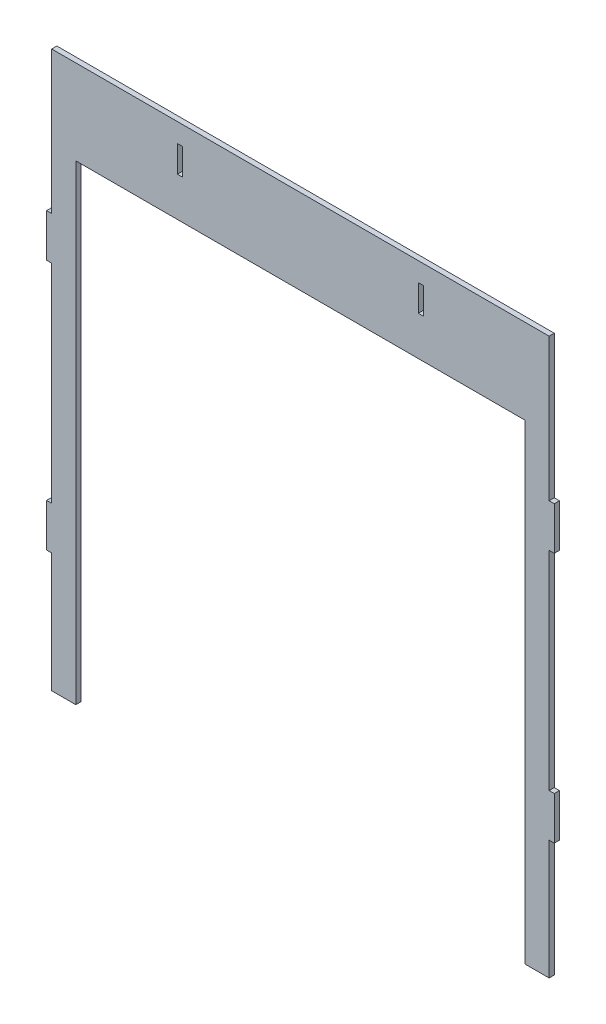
ISO-10303-21;
HEADER;
FILE_DESCRIPTION(('STEP AP214'),'2;1');
FILE_NAME('part.step','',(''),(''),'','','');
FILE_SCHEMA(('AUTOMOTIVE_DESIGN { 1 0 10303 214 1 1 1 1 }'));
ENDSEC;
DATA;
#1=APPLICATION_CONTEXT('core data for automotive mechanical design processes');
#2=APPLICATION_PROTOCOL_DEFINITION('international standard','automotive_design',2000,#1);
#3=PRODUCT_CONTEXT('',#1,'mechanical');
#4=PRODUCT('Part','Part','',(#3));
#5=PRODUCT_RELATED_PRODUCT_CATEGORY('part','',(#4));
#6=PRODUCT_DEFINITION_FORMATION('','',#4);
#7=PRODUCT_DEFINITION_CONTEXT('part definition',#1,'design');
#8=PRODUCT_DEFINITION('design','',#6,#7);
#9=PRODUCT_DEFINITION_SHAPE('','',#8);
#10=(LENGTH_UNIT() NAMED_UNIT(*) SI_UNIT(.MILLI.,.METRE.));
#11=(NAMED_UNIT(*) PLANE_ANGLE_UNIT() SI_UNIT($,.RADIAN.));
#12=(NAMED_UNIT(*) SI_UNIT($,.STERADIAN.) SOLID_ANGLE_UNIT());
#13=UNCERTAINTY_MEASURE_WITH_UNIT(LENGTH_MEASURE(1.E-05),#10,'distance_accuracy_value','');
#14=(GEOMETRIC_REPRESENTATION_CONTEXT(3) GLOBAL_UNCERTAINTY_ASSIGNED_CONTEXT((#13)) GLOBAL_UNIT_ASSIGNED_CONTEXT((#10,
#11,#12)) REPRESENTATION_CONTEXT('',''));
#15=CARTESIAN_POINT('',(0.,0.,0.));
#16=DIRECTION('',(0.,0.,1.));
#17=DIRECTION('',(1.,0.,0.));
#18=AXIS2_PLACEMENT_3D('',#15,#16,#17);
#19=CARTESIAN_POINT('',(0.,61.1688364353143,1.524));
#20=DIRECTION('',(-1.,0.,0.));
#21=DIRECTION('',(0.,0.,1.));
#22=AXIS2_PLACEMENT_3D('',#19,#20,#21);
#23=PLANE('',#22);
#24=DIRECTION('',(0.,1.,0.));
#25=VECTOR('',#24,1.);
#26=CARTESIAN_POINT('',(0.,61.1688364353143,0.));
#27=LINE('',#26,#25);
#28=CARTESIAN_POINT('',(0.,61.1688364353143,0.));
#29=VERTEX_POINT('',#28);
#30=CARTESIAN_POINT('',(0.,122.630588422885,0.));
#31=VERTEX_POINT('',#30);
#32=EDGE_CURVE('E306',#29,#31,#27,.T.);
#33=ORIENTED_EDGE('',*,*,#32,.T.);
#34=DIRECTION('',(0.,0.,-1.));
#35=VECTOR('',#34,1.);
#36=CARTESIAN_POINT('',(0.,122.630588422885,1.524));
#37=LINE('',#36,#35);
#38=CARTESIAN_POINT('',(0.,122.630588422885,1.524));
#39=VERTEX_POINT('',#38);
#40=EDGE_CURVE('E11',#39,#31,#37,.T.);
#41=ORIENTED_EDGE('',*,*,#40,.F.);
#42=DIRECTION('',(0.,1.,0.));
#43=VECTOR('',#42,1.);
#44=CARTESIAN_POINT('',(0.,61.1688364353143,1.524));
#45=LINE('',#44,#43);
#46=CARTESIAN_POINT('',(0.,61.1688364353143,1.524));
#47=VERTEX_POINT('',#46);
#48=EDGE_CURVE('E313',#47,#39,#45,.T.);
#49=ORIENTED_EDGE('',*,*,#48,.F.);
#50=DIRECTION('',(0.,0.,-1.));
#51=VECTOR('',#50,1.);
#52=CARTESIAN_POINT('',(0.,61.1688364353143,1.524));
#53=LINE('',#52,#51);
#54=EDGE_CURVE('E363',#47,#29,#53,.T.);
#55=ORIENTED_EDGE('',*,*,#54,.T.);
#56=EDGE_LOOP('',(#33,#41,#49,#55));
#57=FACE_BOUND('',#56,.T.);
#58=ADVANCED_FACE('F36',(#57),#23,.F.);
#59=CARTESIAN_POINT('',(0.,122.630588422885,1.524));
#60=DIRECTION('',(0.,1.,0.));
#61=DIRECTION('',(0.,0.,1.));
#62=AXIS2_PLACEMENT_3D('',#59,#60,#61);
#63=PLANE('',#62);
#64=DIRECTION('',(1.,0.,0.));
#65=VECTOR('',#64,1.);
#66=CARTESIAN_POINT('',(0.,122.630588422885,0.));
#67=LINE('',#66,#65);
#68=CARTESIAN_POINT('',(1.524,122.630588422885,0.));
#69=VERTEX_POINT('',#68);
#70=EDGE_CURVE('E366',#31,#69,#67,.T.);
#71=ORIENTED_EDGE('',*,*,#70,.T.);
#72=DIRECTION('',(0.,0.,-1.));
#73=VECTOR('',#72,1.);
#74=CARTESIAN_POINT('',(1.524,122.630588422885,1.524));
#75=LINE('',#74,#73);
#76=CARTESIAN_POINT('',(1.524,122.630588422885,1.524));
#77=VERTEX_POINT('',#76);
#78=EDGE_CURVE('E43',#77,#69,#75,.T.);
#79=ORIENTED_EDGE('',*,*,#78,.F.);
#80=DIRECTION('',(1.,0.,0.));
#81=VECTOR('',#80,1.);
#82=CARTESIAN_POINT('',(0.,122.630588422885,1.524));
#83=LINE('',#82,#81);
#84=EDGE_CURVE('E316',#39,#77,#83,.T.);
#85=ORIENTED_EDGE('',*,*,#84,.F.);
#86=ORIENTED_EDGE('',*,*,#40,.T.);
#87=EDGE_LOOP('',(#71,#79,#85,#86));
#88=FACE_BOUND('',#87,.T.);
#89=ADVANCED_FACE('F502',(#88),#63,.F.);
#90=CARTESIAN_POINT('',(1.524,122.630588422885,1.524));
#91=DIRECTION('',(-1.,0.,0.));
#92=DIRECTION('',(0.,0.,1.));
#93=AXIS2_PLACEMENT_3D('',#90,#91,#92);
#94=PLANE('',#93);
#95=DIRECTION('',(0.,1.,0.));
#96=VECTOR('',#95,1.);
#97=CARTESIAN_POINT('',(1.524,122.630588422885,0.));
#98=LINE('',#97,#96);
#99=CARTESIAN_POINT('',(1.524,135.330588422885,0.));
#100=VERTEX_POINT('',#99);
#101=EDGE_CURVE('E368',#69,#100,#98,.T.);
#102=ORIENTED_EDGE('',*,*,#101,.T.);
#103=DIRECTION('',(0.,0.,-1.));
#104=VECTOR('',#103,1.);
#105=CARTESIAN_POINT('',(1.524,135.330588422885,1.524));
#106=LINE('',#105,#104);
#107=CARTESIAN_POINT('',(1.524,135.330588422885,1.524));
#108=VERTEX_POINT('',#107);
#109=EDGE_CURVE('E473',#108,#100,#106,.T.);
#110=ORIENTED_EDGE('',*,*,#109,.F.);
#111=DIRECTION('',(0.,1.,0.));
#112=VECTOR('',#111,1.);
#113=CARTESIAN_POINT('',(1.524,122.630588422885,1.524));
#114=LINE('',#113,#112);
#115=EDGE_CURVE('E319',#77,#108,#114,.T.);
#116=ORIENTED_EDGE('',*,*,#115,.F.);
#117=ORIENTED_EDGE('',*,*,#78,.T.);
#118=EDGE_LOOP('',(#102,#110,#116,#117));
#119=FACE_BOUND('',#118,.T.);
#120=ADVANCED_FACE('F480',(#119),#94,.F.);
#121=CARTESIAN_POINT('',(1.524,135.330588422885,1.524));
#122=DIRECTION('',(0.,-1.,0.));
#123=DIRECTION('',(0.,0.,-1.));
#124=AXIS2_PLACEMENT_3D('',#121,#122,#123);
#125=PLANE('',#124);
#126=DIRECTION('',(-1.,0.,0.));
#127=VECTOR('',#126,1.);
#128=CARTESIAN_POINT('',(1.524,135.330588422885,0.));
#129=LINE('',#128,#127);
#130=CARTESIAN_POINT('',(0.,135.330588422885,0.));
#131=VERTEX_POINT('',#130);
#132=EDGE_CURVE('E370',#100,#131,#129,.T.);
#133=ORIENTED_EDGE('',*,*,#132,.T.);
#134=DIRECTION('',(0.,0.,-1.));
#135=VECTOR('',#134,1.);
#136=CARTESIAN_POINT('',(0.,135.330588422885,1.524));
#137=LINE('',#136,#135);
#138=CARTESIAN_POINT('',(0.,135.330588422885,1.524));
#139=VERTEX_POINT('',#138);
#140=EDGE_CURVE('E470',#139,#131,#137,.T.);
#141=ORIENTED_EDGE('',*,*,#140,.F.);
#142=DIRECTION('',(-1.,0.,0.));
#143=VECTOR('',#142,1.);
#144=CARTESIAN_POINT('',(1.524,135.330588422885,1.524));
#145=LINE('',#144,#143);
#146=EDGE_CURVE('E321',#108,#139,#145,.T.);
#147=ORIENTED_EDGE('',*,*,#146,.F.);
#148=ORIENTED_EDGE('',*,*,#109,.T.);
#149=EDGE_LOOP('',(#133,#141,#147,#148));
#150=FACE_BOUND('',#149,.T.);
#151=ADVANCED_FACE('F490',(#150),#125,.F.);
#152=CARTESIAN_POINT('',(0.,135.330588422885,1.524));
#153=DIRECTION('',(-1.,0.,0.));
#154=DIRECTION('',(0.,0.,1.));
#155=AXIS2_PLACEMENT_3D('',#152,#153,#154);
#156=PLANE('',#155);
#157=DIRECTION('',(0.,1.,0.));
#158=VECTOR('',#157,1.);
#159=CARTESIAN_POINT('',(0.,135.330588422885,0.));
#160=LINE('',#159,#158);
#161=CARTESIAN_POINT('',(0.,177.453164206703,0.));
#162=VERTEX_POINT('',#161);
#163=EDGE_CURVE('E372',#131,#162,#160,.T.);
#164=ORIENTED_EDGE('',*,*,#163,.T.);
#165=DIRECTION('',(0.,0.,-1.));
#166=VECTOR('',#165,1.);
#167=CARTESIAN_POINT('',(0.,177.453164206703,1.524));
#168=LINE('',#167,#166);
#169=CARTESIAN_POINT('',(0.,177.453164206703,1.524));
#170=VERTEX_POINT('',#169);
#171=EDGE_CURVE('E467',#170,#162,#168,.T.);
#172=ORIENTED_EDGE('',*,*,#171,.F.);
#173=DIRECTION('',(0.,1.,0.));
#174=VECTOR('',#173,1.);
#175=CARTESIAN_POINT('',(0.,135.330588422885,1.524));
#176=LINE('',#175,#174);
#177=EDGE_CURVE('E323',#139,#170,#176,.T.);
#178=ORIENTED_EDGE('',*,*,#177,.F.);
#179=ORIENTED_EDGE('',*,*,#140,.T.);
#180=EDGE_LOOP('',(#164,#172,#178,#179));
#181=FACE_BOUND('',#180,.T.);
#182=ADVANCED_FACE('F494',(#181),#156,.F.);
#183=CARTESIAN_POINT('',(0.,177.453164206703,1.524));
#184=DIRECTION('',(0.,-1.,0.));
#185=DIRECTION('',(0.,0.,-1.));
#186=AXIS2_PLACEMENT_3D('',#183,#184,#185);
#187=PLANE('',#186);
#188=DIRECTION('',(-1.,0.,0.));
#189=VECTOR('',#188,1.);
#190=CARTESIAN_POINT('',(0.,177.453164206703,0.));
#191=LINE('',#190,#189);
#192=CARTESIAN_POINT('',(-146.985243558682,177.453164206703,0.));
#193=VERTEX_POINT('',#192);
#194=EDGE_CURVE('E374',#162,#193,#191,.T.);
#195=ORIENTED_EDGE('',*,*,#194,.T.);
#196=DIRECTION('',(0.,0.,-1.));
#197=VECTOR('',#196,1.);
#198=CARTESIAN_POINT('',(-146.985243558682,177.453164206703,1.524));
#199=LINE('',#198,#197);
#200=CARTESIAN_POINT('',(-146.985243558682,177.453164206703,1.524));
#201=VERTEX_POINT('',#200);
#202=EDGE_CURVE('E464',#201,#193,#199,.T.);
#203=ORIENTED_EDGE('',*,*,#202,.F.);
#204=DIRECTION('',(-1.,0.,0.));
#205=VECTOR('',#204,1.);
#206=CARTESIAN_POINT('',(0.,177.453164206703,1.524));
#207=LINE('',#206,#205);
#208=EDGE_CURVE('E325',#170,#201,#207,.T.);
#209=ORIENTED_EDGE('',*,*,#208,.F.);
#210=ORIENTED_EDGE('',*,*,#171,.T.);
#211=EDGE_LOOP('',(#195,#203,#209,#210));
#212=FACE_BOUND('',#211,.T.);
#213=ADVANCED_FACE('F595',(#212),#187,.F.);
#214=CARTESIAN_POINT('',(-146.985243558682,135.330588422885,1.524));
#215=DIRECTION('',(1.,0.,0.));
#216=DIRECTION('',(0.,0.,-1.));
#217=AXIS2_PLACEMENT_3D('',#214,#215,#216);
#218=PLANE('',#217);
#219=DIRECTION('',(0.,-1.,0.));
#220=VECTOR('',#219,1.);
#221=CARTESIAN_POINT('',(-146.985243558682,135.330588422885,0.));
#222=LINE('',#221,#220);
#223=CARTESIAN_POINT('',(-146.985243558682,135.330588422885,0.));
#224=VERTEX_POINT('',#223);
#225=EDGE_CURVE('E376',#193,#224,#222,.T.);
#226=ORIENTED_EDGE('',*,*,#225,.T.);
#227=DIRECTION('',(0.,0.,-1.));
#228=VECTOR('',#227,1.);
#229=CARTESIAN_POINT('',(-146.985243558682,135.330588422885,1.524));
#230=LINE('',#229,#228);
#231=CARTESIAN_POINT('',(-146.985243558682,135.330588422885,1.524));
#232=VERTEX_POINT('',#231);
#233=EDGE_CURVE('E461',#232,#224,#230,.T.);
#234=ORIENTED_EDGE('',*,*,#233,.F.);
#235=DIRECTION('',(0.,-1.,0.));
#236=VECTOR('',#235,1.);
#237=CARTESIAN_POINT('',(-146.985243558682,135.330588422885,1.524));
#238=LINE('',#237,#236);
#239=EDGE_CURVE('E327',#201,#232,#238,.T.);
#240=ORIENTED_EDGE('',*,*,#239,.F.);
#241=ORIENTED_EDGE('',*,*,#202,.T.);
#242=EDGE_LOOP('',(#226,#234,#240,#241));
#243=FACE_BOUND('',#242,.T.);
#244=ADVANCED_FACE('F593',(#243),#218,.F.);
#245=CARTESIAN_POINT('',(-148.509243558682,135.330588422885,1.524));
#246=DIRECTION('',(0.,-1.,0.));
#247=DIRECTION('',(0.,0.,-1.));
#248=AXIS2_PLACEMENT_3D('',#245,#246,#247);
#249=PLANE('',#248);
#250=DIRECTION('',(-1.,0.,0.));
#251=VECTOR('',#250,1.);
#252=CARTESIAN_POINT('',(-148.509243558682,135.330588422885,0.));
#253=LINE('',#252,#251);
#254=CARTESIAN_POINT('',(-148.509243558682,135.330588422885,0.));
#255=VERTEX_POINT('',#254);
#256=EDGE_CURVE('E378',#224,#255,#253,.T.);
#257=ORIENTED_EDGE('',*,*,#256,.T.);
#258=DIRECTION('',(0.,0.,-1.));
#259=VECTOR('',#258,1.);
#260=CARTESIAN_POINT('',(-148.509243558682,135.330588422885,1.524));
#261=LINE('',#260,#259);
#262=CARTESIAN_POINT('',(-148.509243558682,135.330588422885,1.524));
#263=VERTEX_POINT('',#262);
#264=EDGE_CURVE('E458',#263,#255,#261,.T.);
#265=ORIENTED_EDGE('',*,*,#264,.F.);
#266=DIRECTION('',(-1.,0.,0.));
#267=VECTOR('',#266,1.);
#268=CARTESIAN_POINT('',(-148.509243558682,135.330588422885,1.524));
#269=LINE('',#268,#267);
#270=EDGE_CURVE('E329',#232,#263,#269,.T.);
#271=ORIENTED_EDGE('',*,*,#270,.F.);
#272=ORIENTED_EDGE('',*,*,#233,.T.);
#273=EDGE_LOOP('',(#257,#265,#271,#272));
#274=FACE_BOUND('',#273,.T.);
#275=ADVANCED_FACE('F589',(#274),#249,.F.);
#276=CARTESIAN_POINT('',(-148.509243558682,122.630588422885,1.524));
#277=DIRECTION('',(1.,0.,0.));
#278=DIRECTION('',(0.,0.,-1.));
#279=AXIS2_PLACEMENT_3D('',#276,#277,#278);
#280=PLANE('',#279);
#281=DIRECTION('',(0.,-1.,0.));
#282=VECTOR('',#281,1.);
#283=CARTESIAN_POINT('',(-148.509243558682,122.630588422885,0.));
#284=LINE('',#283,#282);
#285=CARTESIAN_POINT('',(-148.509243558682,122.630588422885,0.));
#286=VERTEX_POINT('',#285);
#287=EDGE_CURVE('E380',#255,#286,#284,.T.);
#288=ORIENTED_EDGE('',*,*,#287,.T.);
#289=DIRECTION('',(0.,0.,-1.));
#290=VECTOR('',#289,1.);
#291=CARTESIAN_POINT('',(-148.509243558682,122.630588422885,1.524));
#292=LINE('',#291,#290);
#293=CARTESIAN_POINT('',(-148.509243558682,122.630588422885,1.524));
#294=VERTEX_POINT('',#293);
#295=EDGE_CURVE('E455',#294,#286,#292,.T.);
#296=ORIENTED_EDGE('',*,*,#295,.F.);
#297=DIRECTION('',(0.,-1.,0.));
#298=VECTOR('',#297,1.);
#299=CARTESIAN_POINT('',(-148.509243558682,122.630588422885,1.524));
#300=LINE('',#299,#298);
#301=EDGE_CURVE('E331',#263,#294,#300,.T.);
#302=ORIENTED_EDGE('',*,*,#301,.F.);
#303=ORIENTED_EDGE('',*,*,#264,.T.);
#304=EDGE_LOOP('',(#288,#296,#302,#303));
#305=FACE_BOUND('',#304,.T.);
#306=ADVANCED_FACE('F584',(#305),#280,.F.);
#307=CARTESIAN_POINT('',(-146.985243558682,122.630588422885,1.524));
#308=DIRECTION('',(0.,1.,0.));
#309=DIRECTION('',(0.,0.,1.));
#310=AXIS2_PLACEMENT_3D('',#307,#308,#309);
#311=PLANE('',#310);
#312=DIRECTION('',(1.,0.,0.));
#313=VECTOR('',#312,1.);
#314=CARTESIAN_POINT('',(-146.985243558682,122.630588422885,0.));
#315=LINE('',#314,#313);
#316=CARTESIAN_POINT('',(-146.985243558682,122.630588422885,0.));
#317=VERTEX_POINT('',#316);
#318=EDGE_CURVE('E382',#286,#317,#315,.T.);
#319=ORIENTED_EDGE('',*,*,#318,.T.);
#320=DIRECTION('',(0.,0.,-1.));
#321=VECTOR('',#320,1.);
#322=CARTESIAN_POINT('',(-146.985243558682,122.630588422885,1.524));
#323=LINE('',#322,#321);
#324=CARTESIAN_POINT('',(-146.985243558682,122.630588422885,1.524));
#325=VERTEX_POINT('',#324);
#326=EDGE_CURVE('E452',#325,#317,#323,.T.);
#327=ORIENTED_EDGE('',*,*,#326,.F.);
#328=DIRECTION('',(1.,0.,0.));
#329=VECTOR('',#328,1.);
#330=CARTESIAN_POINT('',(-146.985243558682,122.630588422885,1.524));
#331=LINE('',#330,#329);
#332=EDGE_CURVE('E333',#294,#325,#331,.T.);
#333=ORIENTED_EDGE('',*,*,#332,.F.);
#334=ORIENTED_EDGE('',*,*,#295,.T.);
#335=EDGE_LOOP('',(#319,#327,#333,#334));
#336=FACE_BOUND('',#335,.T.);
#337=ADVANCED_FACE('F578',(#336),#311,.F.);
#338=CARTESIAN_POINT('',(-146.985243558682,61.1688364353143,1.524));
#339=DIRECTION('',(1.,0.,0.));
#340=DIRECTION('',(0.,0.,-1.));
#341=AXIS2_PLACEMENT_3D('',#338,#339,#340);
#342=PLANE('',#341);
#343=DIRECTION('',(0.,-1.,0.));
#344=VECTOR('',#343,1.);
#345=CARTESIAN_POINT('',(-146.985243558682,61.1688364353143,0.));
#346=LINE('',#345,#344);
#347=CARTESIAN_POINT('',(-146.985243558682,61.1688364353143,0.));
#348=VERTEX_POINT('',#347);
#349=EDGE_CURVE('E384',#317,#348,#346,.T.);
#350=ORIENTED_EDGE('',*,*,#349,.T.);
#351=DIRECTION('',(0.,0.,-1.));
#352=VECTOR('',#351,1.);
#353=CARTESIAN_POINT('',(-146.985243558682,61.1688364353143,1.524));
#354=LINE('',#353,#352);
#355=CARTESIAN_POINT('',(-146.985243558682,61.1688364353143,1.524));
#356=VERTEX_POINT('',#355);
#357=EDGE_CURVE('E449',#356,#348,#354,.T.);
#358=ORIENTED_EDGE('',*,*,#357,.F.);
#359=DIRECTION('',(0.,-1.,0.));
#360=VECTOR('',#359,1.);
#361=CARTESIAN_POINT('',(-146.985243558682,61.1688364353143,1.524));
#362=LINE('',#361,#360);
#363=EDGE_CURVE('E335',#325,#356,#362,.T.);
#364=ORIENTED_EDGE('',*,*,#363,.F.);
#365=ORIENTED_EDGE('',*,*,#326,.T.);
#366=EDGE_LOOP('',(#350,#358,#364,#365));
#367=FACE_BOUND('',#366,.T.);
#368=ADVANCED_FACE('F574',(#367),#342,.F.);
#369=CARTESIAN_POINT('',(-146.985243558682,61.1688364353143,1.524));
#370=DIRECTION('',(0.,-1.,0.));
#371=DIRECTION('',(0.,0.,-1.));
#372=AXIS2_PLACEMENT_3D('',#369,#370,#371);
#373=PLANE('',#372);
#374=DIRECTION('',(-1.,0.,0.));
#375=VECTOR('',#374,1.);
#376=CARTESIAN_POINT('',(-146.985243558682,61.1688364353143,0.));
#377=LINE('',#376,#375);
#378=CARTESIAN_POINT('',(-148.509243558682,61.1688364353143,0.));
#379=VERTEX_POINT('',#378);
#380=EDGE_CURVE('E386',#348,#379,#377,.T.);
#381=ORIENTED_EDGE('',*,*,#380,.T.);
#382=DIRECTION('',(0.,0.,-1.));
#383=VECTOR('',#382,1.);
#384=CARTESIAN_POINT('',(-148.509243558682,61.1688364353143,1.524));
#385=LINE('',#384,#383);
#386=CARTESIAN_POINT('',(-148.509243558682,61.1688364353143,1.524));
#387=VERTEX_POINT('',#386);
#388=EDGE_CURVE('E446',#387,#379,#385,.T.);
#389=ORIENTED_EDGE('',*,*,#388,.F.);
#390=DIRECTION('',(-1.,0.,0.));
#391=VECTOR('',#390,1.);
#392=CARTESIAN_POINT('',(-146.985243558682,61.1688364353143,1.524));
#393=LINE('',#392,#391);
#394=EDGE_CURVE('E337',#356,#387,#393,.T.);
#395=ORIENTED_EDGE('',*,*,#394,.F.);
#396=ORIENTED_EDGE('',*,*,#357,.T.);
#397=EDGE_LOOP('',(#381,#389,#395,#396));
#398=FACE_BOUND('',#397,.T.);
#399=ADVANCED_FACE('F569',(#398),#373,.F.);
#400=CARTESIAN_POINT('',(-148.509243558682,61.1688364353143,1.524));
#401=DIRECTION('',(1.,0.,0.));
#402=DIRECTION('',(0.,0.,-1.));
#403=AXIS2_PLACEMENT_3D('',#400,#401,#402);
#404=PLANE('',#403);
#405=DIRECTION('',(0.,-1.,0.));
#406=VECTOR('',#405,1.);
#407=CARTESIAN_POINT('',(-148.509243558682,61.1688364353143,0.));
#408=LINE('',#407,#406);
#409=CARTESIAN_POINT('',(-148.509243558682,48.4688364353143,0.));
#410=VERTEX_POINT('',#409);
#411=EDGE_CURVE('E388',#379,#410,#408,.T.);
#412=ORIENTED_EDGE('',*,*,#411,.T.);
#413=DIRECTION('',(0.,0.,-1.));
#414=VECTOR('',#413,1.);
#415=CARTESIAN_POINT('',(-148.509243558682,48.4688364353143,1.524));
#416=LINE('',#415,#414);
#417=CARTESIAN_POINT('',(-148.509243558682,48.4688364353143,1.524));
#418=VERTEX_POINT('',#417);
#419=EDGE_CURVE('E443',#418,#410,#416,.T.);
#420=ORIENTED_EDGE('',*,*,#419,.F.);
#421=DIRECTION('',(0.,-1.,0.));
#422=VECTOR('',#421,1.);
#423=CARTESIAN_POINT('',(-148.509243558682,61.1688364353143,1.524));
#424=LINE('',#423,#422);
#425=EDGE_CURVE('E339',#387,#418,#424,.T.);
#426=ORIENTED_EDGE('',*,*,#425,.F.);
#427=ORIENTED_EDGE('',*,*,#388,.T.);
#428=EDGE_LOOP('',(#412,#420,#426,#427));
#429=FACE_BOUND('',#428,.T.);
#430=ADVANCED_FACE('F563',(#429),#404,.F.);
#431=CARTESIAN_POINT('',(-148.509243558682,48.4688364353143,1.524));
#432=DIRECTION('',(0.,1.,0.));
#433=DIRECTION('',(0.,0.,1.));
#434=AXIS2_PLACEMENT_3D('',#431,#432,#433);
#435=PLANE('',#434);
#436=DIRECTION('',(1.,0.,0.));
#437=VECTOR('',#436,1.);
#438=CARTESIAN_POINT('',(-148.509243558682,48.4688364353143,0.));
#439=LINE('',#438,#437);
#440=CARTESIAN_POINT('',(-146.985243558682,48.4688364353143,0.));
#441=VERTEX_POINT('',#440);
#442=EDGE_CURVE('E390',#410,#441,#439,.T.);
#443=ORIENTED_EDGE('',*,*,#442,.T.);
#444=DIRECTION('',(0.,0.,-1.));
#445=VECTOR('',#444,1.);
#446=CARTESIAN_POINT('',(-146.985243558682,48.4688364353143,1.524));
#447=LINE('',#446,#445);
#448=CARTESIAN_POINT('',(-146.985243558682,48.4688364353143,1.524));
#449=VERTEX_POINT('',#448);
#450=EDGE_CURVE('E440',#449,#441,#447,.T.);
#451=ORIENTED_EDGE('',*,*,#450,.F.);
#452=DIRECTION('',(1.,0.,0.));
#453=VECTOR('',#452,1.);
#454=CARTESIAN_POINT('',(-148.509243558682,48.4688364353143,1.524));
#455=LINE('',#454,#453);
#456=EDGE_CURVE('E341',#418,#449,#455,.T.);
#457=ORIENTED_EDGE('',*,*,#456,.F.);
#458=ORIENTED_EDGE('',*,*,#419,.T.);
#459=EDGE_LOOP('',(#443,#451,#457,#458));
#460=FACE_BOUND('',#459,.T.);
#461=ADVANCED_FACE('F559',(#460),#435,.F.);
#462=CARTESIAN_POINT('',(-146.985243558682,48.4688364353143,1.524));
#463=DIRECTION('',(1.,0.,0.));
#464=DIRECTION('',(0.,0.,-1.));
#465=AXIS2_PLACEMENT_3D('',#462,#463,#464);
#466=PLANE('',#465);
#467=DIRECTION('',(0.,-1.,0.));
#468=VECTOR('',#467,1.);
#469=CARTESIAN_POINT('',(-146.985243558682,48.4688364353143,0.));
#470=LINE('',#469,#468);
#471=CARTESIAN_POINT('',(-146.985243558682,13.1988771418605,0.));
#472=VERTEX_POINT('',#471);
#473=EDGE_CURVE('E392',#441,#472,#470,.T.);
#474=ORIENTED_EDGE('',*,*,#473,.T.);
#475=DIRECTION('',(0.,0.,-1.));
#476=VECTOR('',#475,1.);
#477=CARTESIAN_POINT('',(-146.985243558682,13.1988771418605,1.524));
#478=LINE('',#477,#476);
#479=CARTESIAN_POINT('',(-146.985243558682,13.1988771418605,1.524));
#480=VERTEX_POINT('',#479);
#481=EDGE_CURVE('E437',#480,#472,#478,.T.);
#482=ORIENTED_EDGE('',*,*,#481,.F.);
#483=DIRECTION('',(0.,-1.,0.));
#484=VECTOR('',#483,1.);
#485=CARTESIAN_POINT('',(-146.985243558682,48.4688364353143,1.524));
#486=LINE('',#485,#484);
#487=EDGE_CURVE('E343',#449,#480,#486,.T.);
#488=ORIENTED_EDGE('',*,*,#487,.F.);
#489=ORIENTED_EDGE('',*,*,#450,.T.);
#490=EDGE_LOOP('',(#474,#482,#488,#489));
#491=FACE_BOUND('',#490,.T.);
#492=ADVANCED_FACE('F554',(#491),#466,.F.);
#493=CARTESIAN_POINT('',(-146.985243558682,13.1988771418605,1.524));
#494=DIRECTION('',(0.,1.,0.));
#495=DIRECTION('',(0.,0.,1.));
#496=AXIS2_PLACEMENT_3D('',#493,#494,#495);
#497=PLANE('',#496);
#498=DIRECTION('',(1.,0.,0.));
#499=VECTOR('',#498,1.);
#500=CARTESIAN_POINT('',(-146.985243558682,13.1988771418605,0.));
#501=LINE('',#500,#499);
#502=CARTESIAN_POINT('',(-139.865695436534,13.1988771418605,0.));
#503=VERTEX_POINT('',#502);
#504=EDGE_CURVE('E394',#472,#503,#501,.T.);
#505=ORIENTED_EDGE('',*,*,#504,.T.);
#506=DIRECTION('',(0.,0.,-1.));
#507=VECTOR('',#506,1.);
#508=CARTESIAN_POINT('',(-139.865695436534,13.1988771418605,1.524));
#509=LINE('',#508,#507);
#510=CARTESIAN_POINT('',(-139.865695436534,13.1988771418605,1.524));
#511=VERTEX_POINT('',#510);
#512=EDGE_CURVE('E434',#511,#503,#509,.T.);
#513=ORIENTED_EDGE('',*,*,#512,.F.);
#514=DIRECTION('',(1.,0.,0.));
#515=VECTOR('',#514,1.);
#516=CARTESIAN_POINT('',(-146.985243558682,13.1988771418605,1.524));
#517=LINE('',#516,#515);
#518=EDGE_CURVE('E345',#480,#511,#517,.T.);
#519=ORIENTED_EDGE('',*,*,#518,.F.);
#520=ORIENTED_EDGE('',*,*,#481,.T.);
#521=EDGE_LOOP('',(#505,#513,#519,#520));
#522=FACE_BOUND('',#521,.T.);
#523=ADVANCED_FACE('F548',(#522),#497,.F.);
#524=CARTESIAN_POINT('',(-139.865695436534,13.1988771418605,1.524));
#525=DIRECTION('',(-1.,0.,0.));
#526=DIRECTION('',(0.,0.,1.));
#527=AXIS2_PLACEMENT_3D('',#524,#525,#526);
#528=PLANE('',#527);
#529=DIRECTION('',(0.,1.,0.));
#530=VECTOR('',#529,1.);
#531=CARTESIAN_POINT('',(-139.865695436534,13.1988771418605,0.));
#532=LINE('',#531,#530);
#533=CARTESIAN_POINT('',(-139.865695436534,152.387429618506,0.));
#534=VERTEX_POINT('',#533);
#535=EDGE_CURVE('E396',#503,#534,#532,.T.);
#536=ORIENTED_EDGE('',*,*,#535,.T.);
#537=DIRECTION('',(0.,0.,-1.));
#538=VECTOR('',#537,1.);
#539=CARTESIAN_POINT('',(-139.865695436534,152.387429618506,1.524));
#540=LINE('',#539,#538);
#541=CARTESIAN_POINT('',(-139.865695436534,152.387429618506,1.524));
#542=VERTEX_POINT('',#541);
#543=EDGE_CURVE('E431',#542,#534,#540,.T.);
#544=ORIENTED_EDGE('',*,*,#543,.F.);
#545=DIRECTION('',(0.,1.,0.));
#546=VECTOR('',#545,1.);
#547=CARTESIAN_POINT('',(-139.865695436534,13.1988771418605,1.524));
#548=LINE('',#547,#546);
#549=EDGE_CURVE('E347',#511,#542,#548,.T.);
#550=ORIENTED_EDGE('',*,*,#549,.F.);
#551=ORIENTED_EDGE('',*,*,#512,.T.);
#552=EDGE_LOOP('',(#536,#544,#550,#551));
#553=FACE_BOUND('',#552,.T.);
#554=ADVANCED_FACE('F544',(#553),#528,.F.);
#555=CARTESIAN_POINT('',(-7.11954812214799,152.387429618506,1.524));
#556=DIRECTION('',(0.,1.,0.));
#557=DIRECTION('',(0.,0.,1.));
#558=AXIS2_PLACEMENT_3D('',#555,#556,#557);
#559=PLANE('',#558);
#560=DIRECTION('',(1.,0.,0.));
#561=VECTOR('',#560,1.);
#562=CARTESIAN_POINT('',(-7.11954812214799,152.387429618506,0.));
#563=LINE('',#562,#561);
#564=CARTESIAN_POINT('',(-7.11954812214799,152.387429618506,0.));
#565=VERTEX_POINT('',#564);
#566=EDGE_CURVE('E398',#534,#565,#563,.T.);
#567=ORIENTED_EDGE('',*,*,#566,.T.);
#568=DIRECTION('',(0.,0.,-1.));
#569=VECTOR('',#568,1.);
#570=CARTESIAN_POINT('',(-7.11954812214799,152.387429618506,1.524));
#571=LINE('',#570,#569);
#572=CARTESIAN_POINT('',(-7.11954812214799,152.387429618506,1.524));
#573=VERTEX_POINT('',#572);
#574=EDGE_CURVE('E428',#573,#565,#571,.T.);
#575=ORIENTED_EDGE('',*,*,#574,.F.);
#576=DIRECTION('',(1.,0.,0.));
#577=VECTOR('',#576,1.);
#578=CARTESIAN_POINT('',(-7.11954812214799,152.387429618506,1.524));
#579=LINE('',#578,#577);
#580=EDGE_CURVE('E349',#542,#573,#579,.T.);
#581=ORIENTED_EDGE('',*,*,#580,.F.);
#582=ORIENTED_EDGE('',*,*,#543,.T.);
#583=EDGE_LOOP('',(#567,#575,#581,#582));
#584=FACE_BOUND('',#583,.T.);
#585=ADVANCED_FACE('F539',(#584),#559,.F.);
#586=CARTESIAN_POINT('',(-7.11954812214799,13.1988771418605,1.524));
#587=DIRECTION('',(1.,0.,0.));
#588=DIRECTION('',(0.,0.,-1.));
#589=AXIS2_PLACEMENT_3D('',#586,#587,#588);
#590=PLANE('',#589);
#591=DIRECTION('',(0.,-1.,0.));
#592=VECTOR('',#591,1.);
#593=CARTESIAN_POINT('',(-7.11954812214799,13.1988771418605,0.));
#594=LINE('',#593,#592);
#595=CARTESIAN_POINT('',(-7.11954812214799,13.1988771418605,0.));
#596=VERTEX_POINT('',#595);
#597=EDGE_CURVE('E400',#565,#596,#594,.T.);
#598=ORIENTED_EDGE('',*,*,#597,.T.);
#599=DIRECTION('',(0.,0.,-1.));
#600=VECTOR('',#599,1.);
#601=CARTESIAN_POINT('',(-7.11954812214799,13.1988771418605,1.524));
#602=LINE('',#601,#600);
#603=CARTESIAN_POINT('',(-7.11954812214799,13.1988771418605,1.524));
#604=VERTEX_POINT('',#603);
#605=EDGE_CURVE('E425',#604,#596,#602,.T.);
#606=ORIENTED_EDGE('',*,*,#605,.F.);
#607=DIRECTION('',(0.,-1.,0.));
#608=VECTOR('',#607,1.);
#609=CARTESIAN_POINT('',(-7.11954812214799,13.1988771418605,1.524));
#610=LINE('',#609,#608);
#611=EDGE_CURVE('E351',#573,#604,#610,.T.);
#612=ORIENTED_EDGE('',*,*,#611,.F.);
#613=ORIENTED_EDGE('',*,*,#574,.T.);
#614=EDGE_LOOP('',(#598,#606,#612,#613));
#615=FACE_BOUND('',#614,.T.);
#616=ADVANCED_FACE('F533',(#615),#590,.F.);
#617=CARTESIAN_POINT('',(0.,13.1988771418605,1.524));
#618=DIRECTION('',(0.,1.,0.));
#619=DIRECTION('',(0.,0.,1.));
#620=AXIS2_PLACEMENT_3D('',#617,#618,#619);
#621=PLANE('',#620);
#622=DIRECTION('',(1.,0.,0.));
#623=VECTOR('',#622,1.);
#624=CARTESIAN_POINT('',(0.,13.1988771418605,0.));
#625=LINE('',#624,#623);
#626=CARTESIAN_POINT('',(0.,13.1988771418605,0.));
#627=VERTEX_POINT('',#626);
#628=EDGE_CURVE('E402',#596,#627,#625,.T.);
#629=ORIENTED_EDGE('',*,*,#628,.T.);
#630=DIRECTION('',(0.,0.,-1.));
#631=VECTOR('',#630,1.);
#632=CARTESIAN_POINT('',(0.,13.1988771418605,1.524));
#633=LINE('',#632,#631);
#634=CARTESIAN_POINT('',(0.,13.1988771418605,1.524));
#635=VERTEX_POINT('',#634);
#636=EDGE_CURVE('E422',#635,#627,#633,.T.);
#637=ORIENTED_EDGE('',*,*,#636,.F.);
#638=DIRECTION('',(1.,0.,0.));
#639=VECTOR('',#638,1.);
#640=CARTESIAN_POINT('',(0.,13.1988771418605,1.524));
#641=LINE('',#640,#639);
#642=EDGE_CURVE('E353',#604,#635,#641,.T.);
#643=ORIENTED_EDGE('',*,*,#642,.F.);
#644=ORIENTED_EDGE('',*,*,#605,.T.);
#645=EDGE_LOOP('',(#629,#637,#643,#644));
#646=FACE_BOUND('',#645,.T.);
#647=ADVANCED_FACE('F529',(#646),#621,.F.);
#648=CARTESIAN_POINT('',(0.,48.4688364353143,1.524));
#649=DIRECTION('',(-1.,0.,0.));
#650=DIRECTION('',(0.,0.,1.));
#651=AXIS2_PLACEMENT_3D('',#648,#649,#650);
#652=PLANE('',#651);
#653=DIRECTION('',(0.,1.,0.));
#654=VECTOR('',#653,1.);
#655=CARTESIAN_POINT('',(0.,48.4688364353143,0.));
#656=LINE('',#655,#654);
#657=CARTESIAN_POINT('',(0.,48.4688364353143,0.));
#658=VERTEX_POINT('',#657);
#659=EDGE_CURVE('E404',#627,#658,#656,.T.);
#660=ORIENTED_EDGE('',*,*,#659,.T.);
#661=DIRECTION('',(0.,0.,-1.));
#662=VECTOR('',#661,1.);
#663=CARTESIAN_POINT('',(0.,48.4688364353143,1.524));
#664=LINE('',#663,#662);
#665=CARTESIAN_POINT('',(0.,48.4688364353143,1.524));
#666=VERTEX_POINT('',#665);
#667=EDGE_CURVE('E419',#666,#658,#664,.T.);
#668=ORIENTED_EDGE('',*,*,#667,.F.);
#669=DIRECTION('',(0.,1.,0.));
#670=VECTOR('',#669,1.);
#671=CARTESIAN_POINT('',(0.,48.4688364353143,1.524));
#672=LINE('',#671,#670);
#673=EDGE_CURVE('E355',#635,#666,#672,.T.);
#674=ORIENTED_EDGE('',*,*,#673,.F.);
#675=ORIENTED_EDGE('',*,*,#636,.T.);
#676=EDGE_LOOP('',(#660,#668,#674,#675));
#677=FACE_BOUND('',#676,.T.);
#678=ADVANCED_FACE('F524',(#677),#652,.F.);
#679=CARTESIAN_POINT('',(1.524,48.4688364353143,1.524));
#680=DIRECTION('',(0.,1.,0.));
#681=DIRECTION('',(0.,0.,1.));
#682=AXIS2_PLACEMENT_3D('',#679,#680,#681);
#683=PLANE('',#682);
#684=DIRECTION('',(1.,0.,0.));
#685=VECTOR('',#684,1.);
#686=CARTESIAN_POINT('',(1.524,48.4688364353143,0.));
#687=LINE('',#686,#685);
#688=CARTESIAN_POINT('',(1.524,48.4688364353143,0.));
#689=VERTEX_POINT('',#688);
#690=EDGE_CURVE('E406',#658,#689,#687,.T.);
#691=ORIENTED_EDGE('',*,*,#690,.T.);
#692=DIRECTION('',(0.,0.,-1.));
#693=VECTOR('',#692,1.);
#694=CARTESIAN_POINT('',(1.524,48.4688364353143,1.524));
#695=LINE('',#694,#693);
#696=CARTESIAN_POINT('',(1.524,48.4688364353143,1.524));
#697=VERTEX_POINT('',#696);
#698=EDGE_CURVE('E416',#697,#689,#695,.T.);
#699=ORIENTED_EDGE('',*,*,#698,.F.);
#700=DIRECTION('',(1.,0.,0.));
#701=VECTOR('',#700,1.);
#702=CARTESIAN_POINT('',(1.524,48.4688364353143,1.524));
#703=LINE('',#702,#701);
#704=EDGE_CURVE('E357',#666,#697,#703,.T.);
#705=ORIENTED_EDGE('',*,*,#704,.F.);
#706=ORIENTED_EDGE('',*,*,#667,.T.);
#707=EDGE_LOOP('',(#691,#699,#705,#706));
#708=FACE_BOUND('',#707,.T.);
#709=ADVANCED_FACE('F518',(#708),#683,.F.);
#710=CARTESIAN_POINT('',(1.524,61.1688364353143,1.524));
#711=DIRECTION('',(-1.,0.,0.));
#712=DIRECTION('',(0.,0.,1.));
#713=AXIS2_PLACEMENT_3D('',#710,#711,#712);
#714=PLANE('',#713);
#715=DIRECTION('',(0.,1.,0.));
#716=VECTOR('',#715,1.);
#717=CARTESIAN_POINT('',(1.524,61.1688364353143,0.));
#718=LINE('',#717,#716);
#719=CARTESIAN_POINT('',(1.524,61.1688364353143,0.));
#720=VERTEX_POINT('',#719);
#721=EDGE_CURVE('E408',#689,#720,#718,.T.);
#722=ORIENTED_EDGE('',*,*,#721,.T.);
#723=DIRECTION('',(0.,0.,-1.));
#724=VECTOR('',#723,1.);
#725=CARTESIAN_POINT('',(1.524,61.1688364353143,1.524));
#726=LINE('',#725,#724);
#727=CARTESIAN_POINT('',(1.524,61.1688364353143,1.524));
#728=VERTEX_POINT('',#727);
#729=EDGE_CURVE('E413',#728,#720,#726,.T.);
#730=ORIENTED_EDGE('',*,*,#729,.F.);
#731=DIRECTION('',(0.,1.,0.));
#732=VECTOR('',#731,1.);
#733=CARTESIAN_POINT('',(1.524,61.1688364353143,1.524));
#734=LINE('',#733,#732);
#735=EDGE_CURVE('E359',#697,#728,#734,.T.);
#736=ORIENTED_EDGE('',*,*,#735,.F.);
#737=ORIENTED_EDGE('',*,*,#698,.T.);
#738=EDGE_LOOP('',(#722,#730,#736,#737));
#739=FACE_BOUND('',#738,.T.);
#740=ADVANCED_FACE('F514',(#739),#714,.F.);
#741=CARTESIAN_POINT('',(0.,61.1688364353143,1.524));
#742=DIRECTION('',(0.,-1.,0.));
#743=DIRECTION('',(0.,0.,-1.));
#744=AXIS2_PLACEMENT_3D('',#741,#742,#743);
#745=PLANE('',#744);
#746=DIRECTION('',(-1.,0.,0.));
#747=VECTOR('',#746,1.);
#748=CARTESIAN_POINT('',(0.,61.1688364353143,0.));
#749=LINE('',#748,#747);
#750=EDGE_CURVE('E317',#720,#29,#749,.T.);
#751=ORIENTED_EDGE('',*,*,#750,.T.);
#752=ORIENTED_EDGE('',*,*,#54,.F.);
#753=DIRECTION('',(-1.,0.,0.));
#754=VECTOR('',#753,1.);
#755=CARTESIAN_POINT('',(0.,61.1688364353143,1.524));
#756=LINE('',#755,#754);
#757=EDGE_CURVE('E361',#728,#47,#756,.T.);
#758=ORIENTED_EDGE('',*,*,#757,.F.);
#759=ORIENTED_EDGE('',*,*,#729,.T.);
#760=EDGE_LOOP('',(#751,#752,#758,#759));
#761=FACE_BOUND('',#760,.T.);
#762=ADVANCED_FACE('F509',(#761),#745,.F.);
#763=CARTESIAN_POINT('',(0.,0.,1.524));
#764=DIRECTION('',(0.,0.,-1.));
#765=DIRECTION('',(-1.,0.,0.));
#766=AXIS2_PLACEMENT_3D('',#763,#764,#765);
#767=PLANE('',#766);
#768=DIRECTION('',(0.,-1.,0.));
#769=VECTOR('',#768,1.);
#770=CARTESIAN_POINT('',(-109.839425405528,171.841179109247,1.524));
#771=LINE('',#770,#769);
#772=CARTESIAN_POINT('',(-109.839425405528,171.841179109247,1.524));
#773=VERTEX_POINT('',#772);
#774=CARTESIAN_POINT('',(-109.839425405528,163.976275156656,1.524));
#775=VERTEX_POINT('',#774);
#776=EDGE_CURVE('E271',#773,#775,#771,.T.);
#777=ORIENTED_EDGE('',*,*,#776,.F.);
#778=DIRECTION('',(-1.,0.,0.));
#779=VECTOR('',#778,1.);
#780=CARTESIAN_POINT('',(-109.839425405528,171.841179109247,1.524));
#781=LINE('',#780,#779);
#782=CARTESIAN_POINT('',(-108.315425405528,171.841179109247,1.524));
#783=VERTEX_POINT('',#782);
#784=EDGE_CURVE('E50',#783,#773,#781,.T.);
#785=ORIENTED_EDGE('',*,*,#784,.F.);
#786=DIRECTION('',(0.,1.,0.));
#787=VECTOR('',#786,1.);
#788=CARTESIAN_POINT('',(-108.315425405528,171.841179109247,1.524));
#789=LINE('',#788,#787);
#790=CARTESIAN_POINT('',(-108.315425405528,163.976275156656,1.524));
#791=VERTEX_POINT('',#790);
#792=EDGE_CURVE('E262',#791,#783,#789,.T.);
#793=ORIENTED_EDGE('',*,*,#792,.F.);
#794=DIRECTION('',(1.,0.,0.));
#795=VECTOR('',#794,1.);
#796=CARTESIAN_POINT('',(-109.839425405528,163.976275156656,1.524));
#797=LINE('',#796,#795);
#798=EDGE_CURVE('E265',#775,#791,#797,.T.);
#799=ORIENTED_EDGE('',*,*,#798,.F.);
#800=EDGE_LOOP('',(#777,#785,#793,#799));
#801=FACE_BOUND('',#800,.T.);
#802=DIRECTION('',(-1.,0.,0.));
#803=VECTOR('',#802,1.);
#804=CARTESIAN_POINT('',(-37.1458181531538,171.841179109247,1.524));
#805=LINE('',#804,#803);
#806=CARTESIAN_POINT('',(-37.1458181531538,171.841179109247,1.524));
#807=VERTEX_POINT('',#806);
#808=CARTESIAN_POINT('',(-38.6698181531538,171.841179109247,1.524));
#809=VERTEX_POINT('',#808);
#810=EDGE_CURVE('E296',#807,#809,#805,.T.);
#811=ORIENTED_EDGE('',*,*,#810,.F.);
#812=DIRECTION('',(0.,1.,0.));
#813=VECTOR('',#812,1.);
#814=CARTESIAN_POINT('',(-37.1458181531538,171.841179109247,1.524));
#815=LINE('',#814,#813);
#816=CARTESIAN_POINT('',(-37.1458181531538,163.976275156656,1.524));
#817=VERTEX_POINT('',#816);
#818=EDGE_CURVE('E277',#817,#807,#815,.T.);
#819=ORIENTED_EDGE('',*,*,#818,.F.);
#820=DIRECTION('',(1.,0.,0.));
#821=VECTOR('',#820,1.);
#822=CARTESIAN_POINT('',(-37.1458181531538,163.976275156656,1.524));
#823=LINE('',#822,#821);
#824=CARTESIAN_POINT('',(-38.6698181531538,163.976275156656,1.524));
#825=VERTEX_POINT('',#824);
#826=EDGE_CURVE('E285',#825,#817,#823,.T.);
#827=ORIENTED_EDGE('',*,*,#826,.F.);
#828=DIRECTION('',(0.,-1.,0.));
#829=VECTOR('',#828,1.);
#830=CARTESIAN_POINT('',(-38.6698181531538,171.841179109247,1.524));
#831=LINE('',#830,#829);
#832=EDGE_CURVE('E299',#809,#825,#831,.T.);
#833=ORIENTED_EDGE('',*,*,#832,.F.);
#834=EDGE_LOOP('',(#811,#819,#827,#833));
#835=FACE_BOUND('',#834,.T.);
#836=ORIENTED_EDGE('',*,*,#48,.T.);
#837=ORIENTED_EDGE('',*,*,#84,.T.);
#838=ORIENTED_EDGE('',*,*,#115,.T.);
#839=ORIENTED_EDGE('',*,*,#146,.T.);
#840=ORIENTED_EDGE('',*,*,#177,.T.);
#841=ORIENTED_EDGE('',*,*,#208,.T.);
#842=ORIENTED_EDGE('',*,*,#239,.T.);
#843=ORIENTED_EDGE('',*,*,#270,.T.);
#844=ORIENTED_EDGE('',*,*,#301,.T.);
#845=ORIENTED_EDGE('',*,*,#332,.T.);
#846=ORIENTED_EDGE('',*,*,#363,.T.);
#847=ORIENTED_EDGE('',*,*,#394,.T.);
#848=ORIENTED_EDGE('',*,*,#425,.T.);
#849=ORIENTED_EDGE('',*,*,#456,.T.);
#850=ORIENTED_EDGE('',*,*,#487,.T.);
#851=ORIENTED_EDGE('',*,*,#518,.T.);
#852=ORIENTED_EDGE('',*,*,#549,.T.);
#853=ORIENTED_EDGE('',*,*,#580,.T.);
#854=ORIENTED_EDGE('',*,*,#611,.T.);
#855=ORIENTED_EDGE('',*,*,#642,.T.);
#856=ORIENTED_EDGE('',*,*,#673,.T.);
#857=ORIENTED_EDGE('',*,*,#704,.T.);
#858=ORIENTED_EDGE('',*,*,#735,.T.);
#859=ORIENTED_EDGE('',*,*,#757,.T.);
#860=EDGE_LOOP('',(#836,#837,#838,#839,#840,#841,#842,#843,#844,#845,#846,#847,#848,#849,#850,
#851,#852,#853,#854,#855,#856,#857,#858,#859));
#861=FACE_BOUND('',#860,.T.);
#862=ADVANCED_FACE('F498',(#801,#835,#861),#767,.F.);
#863=CARTESIAN_POINT('',(0.,0.,0.));
#864=DIRECTION('',(0.,0.,-1.));
#865=DIRECTION('',(-1.,0.,0.));
#866=AXIS2_PLACEMENT_3D('',#863,#864,#865);
#867=PLANE('',#866);
#868=DIRECTION('',(-1.,0.,0.));
#869=VECTOR('',#868,1.);
#870=CARTESIAN_POINT('',(-109.839425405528,171.841179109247,0.));
#871=LINE('',#870,#869);
#872=CARTESIAN_POINT('',(-108.315425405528,171.841179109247,0.));
#873=VERTEX_POINT('',#872);
#874=CARTESIAN_POINT('',(-109.839425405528,171.841179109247,0.));
#875=VERTEX_POINT('',#874);
#876=EDGE_CURVE('E246',#873,#875,#871,.T.);
#877=ORIENTED_EDGE('',*,*,#876,.T.);
#878=DIRECTION('',(0.,-1.,0.));
#879=VECTOR('',#878,1.);
#880=CARTESIAN_POINT('',(-109.839425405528,171.841179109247,0.));
#881=LINE('',#880,#879);
#882=CARTESIAN_POINT('',(-109.839425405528,163.976275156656,0.));
#883=VERTEX_POINT('',#882);
#884=EDGE_CURVE('E255',#875,#883,#881,.T.);
#885=ORIENTED_EDGE('',*,*,#884,.T.);
#886=DIRECTION('',(1.,0.,0.));
#887=VECTOR('',#886,1.);
#888=CARTESIAN_POINT('',(-109.839425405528,163.976275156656,0.));
#889=LINE('',#888,#887);
#890=CARTESIAN_POINT('',(-108.315425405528,163.976275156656,0.));
#891=VERTEX_POINT('',#890);
#892=EDGE_CURVE('E58',#883,#891,#889,.T.);
#893=ORIENTED_EDGE('',*,*,#892,.T.);
#894=DIRECTION('',(0.,1.,0.));
#895=VECTOR('',#894,1.);
#896=CARTESIAN_POINT('',(-108.315425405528,171.841179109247,0.));
#897=LINE('',#896,#895);
#898=EDGE_CURVE('E252',#891,#873,#897,.T.);
#899=ORIENTED_EDGE('',*,*,#898,.T.);
#900=EDGE_LOOP('',(#877,#885,#893,#899));
#901=FACE_BOUND('',#900,.T.);
#902=DIRECTION('',(0.,1.,0.));
#903=VECTOR('',#902,1.);
#904=CARTESIAN_POINT('',(-37.1458181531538,171.841179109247,0.));
#905=LINE('',#904,#903);
#906=CARTESIAN_POINT('',(-37.1458181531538,163.976275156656,0.));
#907=VERTEX_POINT('',#906);
#908=CARTESIAN_POINT('',(-37.1458181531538,171.841179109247,0.));
#909=VERTEX_POINT('',#908);
#910=EDGE_CURVE('E281',#907,#909,#905,.T.);
#911=ORIENTED_EDGE('',*,*,#910,.T.);
#912=DIRECTION('',(-1.,0.,0.));
#913=VECTOR('',#912,1.);
#914=CARTESIAN_POINT('',(-37.1458181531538,171.841179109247,0.));
#915=LINE('',#914,#913);
#916=CARTESIAN_POINT('',(-38.6698181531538,171.841179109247,0.));
#917=VERTEX_POINT('',#916);
#918=EDGE_CURVE('E284',#909,#917,#915,.T.);
#919=ORIENTED_EDGE('',*,*,#918,.T.);
#920=DIRECTION('',(0.,-1.,0.));
#921=VECTOR('',#920,1.);
#922=CARTESIAN_POINT('',(-38.6698181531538,171.841179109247,0.));
#923=LINE('',#922,#921);
#924=CARTESIAN_POINT('',(-38.6698181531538,163.976275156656,0.));
#925=VERTEX_POINT('',#924);
#926=EDGE_CURVE('E288',#917,#925,#923,.T.);
#927=ORIENTED_EDGE('',*,*,#926,.T.);
#928=DIRECTION('',(1.,0.,0.));
#929=VECTOR('',#928,1.);
#930=CARTESIAN_POINT('',(-37.1458181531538,163.976275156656,0.));
#931=LINE('',#930,#929);
#932=EDGE_CURVE('E291',#925,#907,#931,.T.);
#933=ORIENTED_EDGE('',*,*,#932,.T.);
#934=EDGE_LOOP('',(#911,#919,#927,#933));
#935=FACE_BOUND('',#934,.T.);
#936=ORIENTED_EDGE('',*,*,#32,.F.);
#937=ORIENTED_EDGE('',*,*,#750,.F.);
#938=ORIENTED_EDGE('',*,*,#721,.F.);
#939=ORIENTED_EDGE('',*,*,#690,.F.);
#940=ORIENTED_EDGE('',*,*,#659,.F.);
#941=ORIENTED_EDGE('',*,*,#628,.F.);
#942=ORIENTED_EDGE('',*,*,#597,.F.);
#943=ORIENTED_EDGE('',*,*,#566,.F.);
#944=ORIENTED_EDGE('',*,*,#535,.F.);
#945=ORIENTED_EDGE('',*,*,#504,.F.);
#946=ORIENTED_EDGE('',*,*,#473,.F.);
#947=ORIENTED_EDGE('',*,*,#442,.F.);
#948=ORIENTED_EDGE('',*,*,#411,.F.);
#949=ORIENTED_EDGE('',*,*,#380,.F.);
#950=ORIENTED_EDGE('',*,*,#349,.F.);
#951=ORIENTED_EDGE('',*,*,#318,.F.);
#952=ORIENTED_EDGE('',*,*,#287,.F.);
#953=ORIENTED_EDGE('',*,*,#256,.F.);
#954=ORIENTED_EDGE('',*,*,#225,.F.);
#955=ORIENTED_EDGE('',*,*,#194,.F.);
#956=ORIENTED_EDGE('',*,*,#163,.F.);
#957=ORIENTED_EDGE('',*,*,#132,.F.);
#958=ORIENTED_EDGE('',*,*,#101,.F.);
#959=ORIENTED_EDGE('',*,*,#70,.F.);
#960=EDGE_LOOP('',(#936,#937,#938,#939,#940,#941,#942,#943,#944,#945,#946,#947,#948,#949,#950,
#951,#952,#953,#954,#955,#956,#957,#958,#959));
#961=FACE_BOUND('',#960,.T.);
#962=ADVANCED_FACE('F259',(#901,#935,#961),#867,.T.);
#963=CARTESIAN_POINT('',(-37.1458181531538,171.841179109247,0.));
#964=DIRECTION('',(1.,0.,0.));
#965=DIRECTION('',(0.,0.,-1.));
#966=AXIS2_PLACEMENT_3D('',#963,#964,#965);
#967=PLANE('',#966);
#968=ORIENTED_EDGE('',*,*,#818,.T.);
#969=DIRECTION('',(0.,0.,1.));
#970=VECTOR('',#969,1.);
#971=CARTESIAN_POINT('',(-37.1458181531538,171.841179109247,0.));
#972=LINE('',#971,#970);
#973=EDGE_CURVE('E294',#909,#807,#972,.T.);
#974=ORIENTED_EDGE('',*,*,#973,.F.);
#975=ORIENTED_EDGE('',*,*,#910,.F.);
#976=DIRECTION('',(0.,0.,1.));
#977=VECTOR('',#976,1.);
#978=CARTESIAN_POINT('',(-37.1458181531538,163.976275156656,0.));
#979=LINE('',#978,#977);
#980=EDGE_CURVE('E304',#907,#817,#979,.T.);
#981=ORIENTED_EDGE('',*,*,#980,.T.);
#982=EDGE_LOOP('',(#968,#974,#975,#981));
#983=FACE_BOUND('',#982,.T.);
#984=ADVANCED_FACE('F786',(#983),#967,.F.);
#985=CARTESIAN_POINT('',(-37.1458181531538,163.976275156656,0.));
#986=DIRECTION('',(0.,-1.,0.));
#987=DIRECTION('',(0.,0.,-1.));
#988=AXIS2_PLACEMENT_3D('',#985,#986,#987);
#989=PLANE('',#988);
#990=ORIENTED_EDGE('',*,*,#826,.T.);
#991=ORIENTED_EDGE('',*,*,#980,.F.);
#992=ORIENTED_EDGE('',*,*,#932,.F.);
#993=DIRECTION('',(0.,0.,1.));
#994=VECTOR('',#993,1.);
#995=CARTESIAN_POINT('',(-38.6698181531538,163.976275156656,0.));
#996=LINE('',#995,#994);
#997=EDGE_CURVE('E307',#925,#825,#996,.T.);
#998=ORIENTED_EDGE('',*,*,#997,.T.);
#999=EDGE_LOOP('',(#990,#991,#992,#998));
#1000=FACE_BOUND('',#999,.T.);
#1001=ADVANCED_FACE('F795',(#1000),#989,.F.);
#1002=CARTESIAN_POINT('',(-38.6698181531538,171.841179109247,0.));
#1003=DIRECTION('',(-1.,0.,0.));
#1004=DIRECTION('',(0.,0.,1.));
#1005=AXIS2_PLACEMENT_3D('',#1002,#1003,#1004);
#1006=PLANE('',#1005);
#1007=ORIENTED_EDGE('',*,*,#832,.T.);
#1008=ORIENTED_EDGE('',*,*,#997,.F.);
#1009=ORIENTED_EDGE('',*,*,#926,.F.);
#1010=DIRECTION('',(0.,0.,1.));
#1011=VECTOR('',#1010,1.);
#1012=CARTESIAN_POINT('',(-38.6698181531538,171.841179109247,0.));
#1013=LINE('',#1012,#1011);
#1014=EDGE_CURVE('E309',#917,#809,#1013,.T.);
#1015=ORIENTED_EDGE('',*,*,#1014,.T.);
#1016=EDGE_LOOP('',(#1007,#1008,#1009,#1015));
#1017=FACE_BOUND('',#1016,.T.);
#1018=ADVANCED_FACE('F805',(#1017),#1006,.F.);
#1019=CARTESIAN_POINT('',(-37.1458181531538,171.841179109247,0.));
#1020=DIRECTION('',(0.,1.,0.));
#1021=DIRECTION('',(0.,0.,1.));
#1022=AXIS2_PLACEMENT_3D('',#1019,#1020,#1021);
#1023=PLANE('',#1022);
#1024=ORIENTED_EDGE('',*,*,#810,.T.);
#1025=ORIENTED_EDGE('',*,*,#1014,.F.);
#1026=ORIENTED_EDGE('',*,*,#918,.F.);
#1027=ORIENTED_EDGE('',*,*,#973,.T.);
#1028=EDGE_LOOP('',(#1024,#1025,#1026,#1027));
#1029=FACE_BOUND('',#1028,.T.);
#1030=ADVANCED_FACE('F815',(#1029),#1023,.F.);
#1031=CARTESIAN_POINT('',(-109.839425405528,171.841179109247,0.));
#1032=DIRECTION('',(0.,1.,0.));
#1033=DIRECTION('',(0.,0.,1.));
#1034=AXIS2_PLACEMENT_3D('',#1031,#1032,#1033);
#1035=PLANE('',#1034);
#1036=ORIENTED_EDGE('',*,*,#784,.T.);
#1037=DIRECTION('',(0.,0.,1.));
#1038=VECTOR('',#1037,1.);
#1039=CARTESIAN_POINT('',(-109.839425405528,171.841179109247,0.));
#1040=LINE('',#1039,#1038);
#1041=EDGE_CURVE('E242',#875,#773,#1040,.T.);
#1042=ORIENTED_EDGE('',*,*,#1041,.F.);
#1043=ORIENTED_EDGE('',*,*,#876,.F.);
#1044=DIRECTION('',(0.,0.,1.));
#1045=VECTOR('',#1044,1.);
#1046=CARTESIAN_POINT('',(-108.315425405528,171.841179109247,0.));
#1047=LINE('',#1046,#1045);
#1048=EDGE_CURVE('E275',#873,#783,#1047,.T.);
#1049=ORIENTED_EDGE('',*,*,#1048,.T.);
#1050=EDGE_LOOP('',(#1036,#1042,#1043,#1049));
#1051=FACE_BOUND('',#1050,.T.);
#1052=ADVANCED_FACE('F244',(#1051),#1035,.F.);
#1053=CARTESIAN_POINT('',(-108.315425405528,171.841179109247,0.));
#1054=DIRECTION('',(1.,0.,0.));
#1055=DIRECTION('',(0.,0.,-1.));
#1056=AXIS2_PLACEMENT_3D('',#1053,#1054,#1055);
#1057=PLANE('',#1056);
#1058=ORIENTED_EDGE('',*,*,#792,.T.);
#1059=ORIENTED_EDGE('',*,*,#1048,.F.);
#1060=ORIENTED_EDGE('',*,*,#898,.F.);
#1061=DIRECTION('',(0.,0.,1.));
#1062=VECTOR('',#1061,1.);
#1063=CARTESIAN_POINT('',(-108.315425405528,163.976275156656,0.));
#1064=LINE('',#1063,#1062);
#1065=EDGE_CURVE('E278',#891,#791,#1064,.T.);
#1066=ORIENTED_EDGE('',*,*,#1065,.T.);
#1067=EDGE_LOOP('',(#1058,#1059,#1060,#1066));
#1068=FACE_BOUND('',#1067,.T.);
#1069=ADVANCED_FACE('F834',(#1068),#1057,.F.);
#1070=CARTESIAN_POINT('',(-109.839425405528,163.976275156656,0.));
#1071=DIRECTION('',(0.,-1.,0.));
#1072=DIRECTION('',(0.,0.,-1.));
#1073=AXIS2_PLACEMENT_3D('',#1070,#1071,#1072);
#1074=PLANE('',#1073);
#1075=ORIENTED_EDGE('',*,*,#798,.T.);
#1076=ORIENTED_EDGE('',*,*,#1065,.F.);
#1077=ORIENTED_EDGE('',*,*,#892,.F.);
#1078=DIRECTION('',(0.,0.,1.));
#1079=VECTOR('',#1078,1.);
#1080=CARTESIAN_POINT('',(-109.839425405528,163.976275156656,0.));
#1081=LINE('',#1080,#1079);
#1082=EDGE_CURVE('E251',#883,#775,#1081,.T.);
#1083=ORIENTED_EDGE('',*,*,#1082,.T.);
#1084=EDGE_LOOP('',(#1075,#1076,#1077,#1083));
#1085=FACE_BOUND('',#1084,.T.);
#1086=ADVANCED_FACE('F843',(#1085),#1074,.F.);
#1087=CARTESIAN_POINT('',(-109.839425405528,171.841179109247,0.));
#1088=DIRECTION('',(-1.,0.,0.));
#1089=DIRECTION('',(0.,0.,1.));
#1090=AXIS2_PLACEMENT_3D('',#1087,#1088,#1089);
#1091=PLANE('',#1090);
#1092=ORIENTED_EDGE('',*,*,#776,.T.);
#1093=ORIENTED_EDGE('',*,*,#1082,.F.);
#1094=ORIENTED_EDGE('',*,*,#884,.F.);
#1095=ORIENTED_EDGE('',*,*,#1041,.T.);
#1096=EDGE_LOOP('',(#1092,#1093,#1094,#1095));
#1097=FACE_BOUND('',#1096,.T.);
#1098=ADVANCED_FACE('F256',(#1097),#1091,.F.);
#1099=CLOSED_SHELL('',(#58,#89,#120,#151,#182,#213,#244,#275,#306,#337,#368,#399,#430,#461,#492,
#523,#554,#585,#616,#647,#678,#709,#740,#762,#862,#962,#984,#1001,#1018,#1030,#1052,#1069,#1086,#1098));
#1100=MANIFOLD_SOLID_BREP('B2',#1099);
#1101=ADVANCED_BREP_SHAPE_REPRESENTATION('',(#18,#1100),#14);
#1102=SHAPE_DEFINITION_REPRESENTATION(#9,#1101);
ENDSEC;
END-ISO-10303-21;
